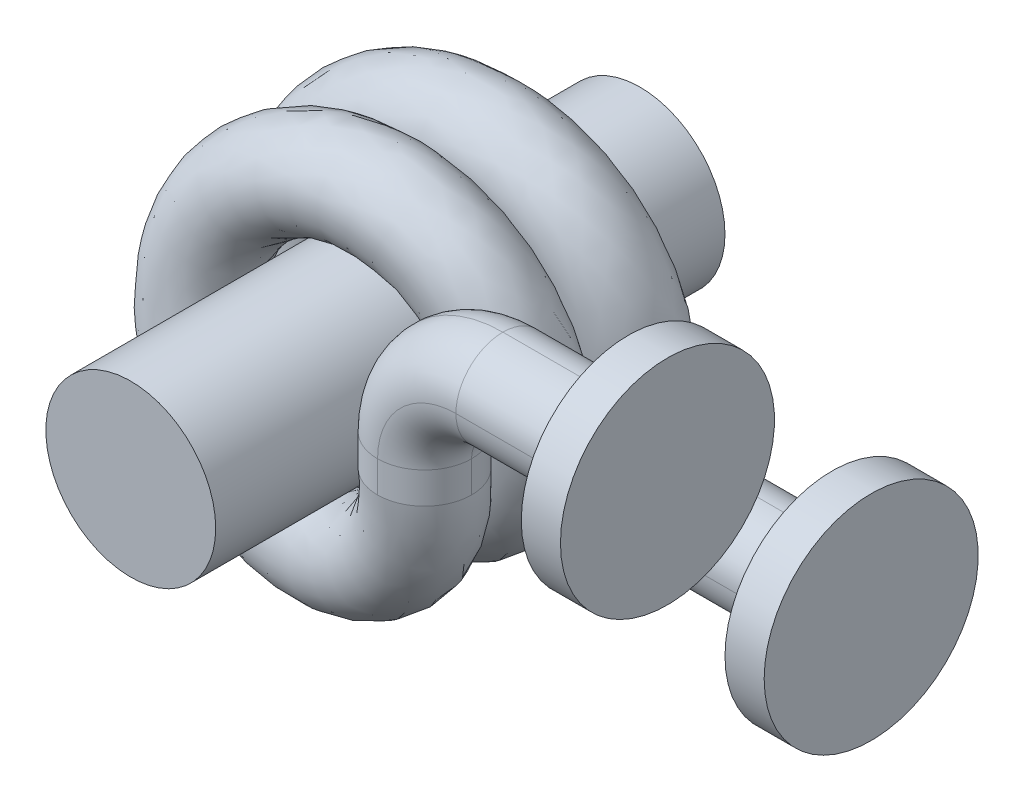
ISO-10303-21;
HEADER;
FILE_DESCRIPTION(('STEP AP214'),'2;1');
FILE_NAME('part.step','',(''),(''),'','','');
FILE_SCHEMA(('AUTOMOTIVE_DESIGN { 1 0 10303 214 1 1 1 1 }'));
ENDSEC;
DATA;
#1=APPLICATION_CONTEXT('core data for automotive mechanical design processes');
#2=APPLICATION_PROTOCOL_DEFINITION('international standard','automotive_design',2000,#1);
#3=PRODUCT_CONTEXT('',#1,'mechanical');
#4=PRODUCT('Part','Part','',(#3));
#5=PRODUCT_RELATED_PRODUCT_CATEGORY('part','',(#4));
#6=PRODUCT_DEFINITION_FORMATION('','',#4);
#7=PRODUCT_DEFINITION_CONTEXT('part definition',#1,'design');
#8=PRODUCT_DEFINITION('design','',#6,#7);
#9=PRODUCT_DEFINITION_SHAPE('','',#8);
#10=(LENGTH_UNIT() NAMED_UNIT(*) SI_UNIT(.MILLI.,.METRE.));
#11=(NAMED_UNIT(*) PLANE_ANGLE_UNIT() SI_UNIT($,.RADIAN.));
#12=(NAMED_UNIT(*) SI_UNIT($,.STERADIAN.) SOLID_ANGLE_UNIT());
#13=UNCERTAINTY_MEASURE_WITH_UNIT(LENGTH_MEASURE(1.E-05),#10,'distance_accuracy_value','');
#14=(GEOMETRIC_REPRESENTATION_CONTEXT(3) GLOBAL_UNCERTAINTY_ASSIGNED_CONTEXT((#13)) GLOBAL_UNIT_ASSIGNED_CONTEXT((#10,
#11,#12)) REPRESENTATION_CONTEXT('',''));
#15=CARTESIAN_POINT('',(0.,0.,0.));
#16=DIRECTION('',(0.,0.,1.));
#17=DIRECTION('',(1.,0.,0.));
#18=AXIS2_PLACEMENT_3D('',#15,#16,#17);
#19=CARTESIAN_POINT('',(0.,0.,2.));
#20=DIRECTION('',(0.,0.,-1.));
#21=DIRECTION('',(1.,0.,0.));
#22=AXIS2_PLACEMENT_3D('',#19,#20,#21);
#23=CYLINDRICAL_SURFACE('',#22,1.08399992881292);
#24=CARTESIAN_POINT('',(0.,0.,2.));
#25=DIRECTION('',(0.,0.,1.));
#26=DIRECTION('',(1.,0.,0.));
#27=AXIS2_PLACEMENT_3D('',#24,#25,#26);
#28=CIRCLE('',#27,1.08399992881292);
#29=CARTESIAN_POINT('',(1.08399992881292,0.,2.));
#30=VERTEX_POINT('',#29);
#31=EDGE_CURVE('E11',#30,#30,#28,.T.);
#32=ORIENTED_EDGE('',*,*,#31,.F.);
#33=EDGE_LOOP('',(#32));
#34=FACE_BOUND('',#33,.T.);
#35=CARTESIAN_POINT('',(0.,0.,-4.5));
#36=DIRECTION('',(0.,0.,1.));
#37=DIRECTION('',(1.,0.,0.));
#38=AXIS2_PLACEMENT_3D('',#35,#36,#37);
#39=CIRCLE('',#38,1.08399992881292);
#40=CARTESIAN_POINT('',(1.08399992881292,0.,-4.5));
#41=VERTEX_POINT('',#40);
#42=EDGE_CURVE('E51',#41,#41,#39,.T.);
#43=ORIENTED_EDGE('',*,*,#42,.T.);
#44=EDGE_LOOP('',(#43));
#45=FACE_BOUND('',#44,.T.);
#46=ADVANCED_FACE('F45',(#34,#45),#23,.T.);
#47=CARTESIAN_POINT('',(0.,0.,2.));
#48=DIRECTION('',(0.,0.,-1.));
#49=DIRECTION('',(1.,0.,0.));
#50=AXIS2_PLACEMENT_3D('',#47,#48,#49);
#51=PLANE('',#50);
#52=ORIENTED_EDGE('',*,*,#31,.T.);
#53=EDGE_LOOP('',(#52));
#54=FACE_BOUND('',#53,.T.);
#55=ADVANCED_FACE('F60',(#54),#51,.F.);
#56=CARTESIAN_POINT('',(0.,0.,-4.5));
#57=DIRECTION('',(0.,0.,-1.));
#58=DIRECTION('',(1.,0.,0.));
#59=AXIS2_PLACEMENT_3D('',#56,#57,#58);
#60=PLANE('',#59);
#61=ORIENTED_EDGE('',*,*,#42,.F.);
#62=EDGE_LOOP('',(#61));
#63=FACE_BOUND('',#62,.T.);
#64=ADVANCED_FACE('F58',(#63),#60,.T.);
#65=CLOSED_SHELL('',(#46,#55,#64));
#66=MANIFOLD_SOLID_BREP('B2',#65);
#67=CARTESIAN_POINT('',(1.75,278.593538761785,30.6271281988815));
#68=CARTESIAN_POINT('',(1.75,182.157313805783,19.8177376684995));
#69=CARTESIAN_POINT('',(1.75,85.7210888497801,9.00834713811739));
#70=CARTESIAN_POINT('',(1.75,53.5756805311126,5.40521696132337));
#71=CARTESIAN_POINT('',(1.75,21.430272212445,1.80208678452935));
#72=CARTESIAN_POINT('',(1.75,10.7151361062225,0.601043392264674));
#73=CARTESIAN_POINT('',(1.75,0.,-0.6));
#74=CARTESIAN_POINT('',(1.75,-0.724873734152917,-0.68125));
#75=CARTESIAN_POINT('',(1.23743686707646,-1.23743686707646,-0.7625));
#76=CARTESIAN_POINT('',(0.724873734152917,-1.75,-0.84375));
#77=CARTESIAN_POINT('',(0.,-1.75,-0.925));
#78=CARTESIAN_POINT('',(-0.724873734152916,-1.75,-1.00625));
#79=CARTESIAN_POINT('',(-1.23743686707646,-1.23743686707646,-1.0875));
#80=CARTESIAN_POINT('',(-1.75,-0.724873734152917,-1.16875));
#81=CARTESIAN_POINT('',(-1.75,0.,-1.25));
#82=CARTESIAN_POINT('',(-1.75,0.724873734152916,-1.33125));
#83=CARTESIAN_POINT('',(-1.23743686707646,1.23743686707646,-1.4125));
#84=CARTESIAN_POINT('',(-0.724873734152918,1.75,-1.49375));
#85=CARTESIAN_POINT('',(0.,1.75,-1.575));
#86=CARTESIAN_POINT('',(0.724873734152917,1.75,-1.65625));
#87=CARTESIAN_POINT('',(1.23743686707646,1.23743686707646,-1.7375));
#88=CARTESIAN_POINT('',(1.75,0.724873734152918,-1.81875));
#89=CARTESIAN_POINT('',(1.75,0.,-1.9));
#90=CARTESIAN_POINT('',(1.75,-0.724873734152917,-1.98125));
#91=CARTESIAN_POINT('',(1.23743686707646,-1.23743686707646,-2.0625));
#92=CARTESIAN_POINT('',(0.724873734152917,-1.75,-2.14375));
#93=CARTESIAN_POINT('',(0.,-1.75,-2.225));
#94=CARTESIAN_POINT('',(-0.724873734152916,-1.75,-2.30625));
#95=CARTESIAN_POINT('',(-1.23743686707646,-1.23743686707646,-2.3875));
#96=CARTESIAN_POINT('',(-1.75,-0.724873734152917,-2.46875));
#97=CARTESIAN_POINT('',(-1.75,0.,-2.55));
#98=CARTESIAN_POINT('',(-1.75,0.724873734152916,-2.63125));
#99=CARTESIAN_POINT('',(-1.23743686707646,1.23743686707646,-2.7125));
#100=CARTESIAN_POINT('',(-0.724873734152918,1.75,-2.79375));
#101=CARTESIAN_POINT('',(0.,1.75,-2.875));
#102=CARTESIAN_POINT('',(0.724873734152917,1.75,-2.95625));
#103=CARTESIAN_POINT('',(1.23743686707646,1.23743686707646,-3.0375));
#104=CARTESIAN_POINT('',(1.75,0.724873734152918,-3.11875));
#105=CARTESIAN_POINT('',(1.75,0.,-3.2));
#106=CARTESIAN_POINT('',(1.75000000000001,-10.7151361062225,-4.40104339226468));
#107=CARTESIAN_POINT('',(1.75000000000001,-21.4302722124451,-5.60208678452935));
#108=CARTESIAN_POINT('',(1.75000000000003,-53.5756805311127,-9.20521696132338));
#109=CARTESIAN_POINT('',(1.75000000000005,-85.7210888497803,-12.8083471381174));
#110=CARTESIAN_POINT('',(1.75000000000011,-182.157313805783,-23.6177376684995));
#111=CARTESIAN_POINT('',(1.75000000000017,-278.593538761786,-34.4271281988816));
#112=CARTESIAN_POINT('',(2.95,469.629108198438,30.6271281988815));
#113=CARTESIAN_POINT('',(2.95,307.065186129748,19.8177376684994));
#114=CARTESIAN_POINT('',(2.95,144.501264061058,9.00834713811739));
#115=CARTESIAN_POINT('',(2.95,90.3132900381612,5.40521696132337));
#116=CARTESIAN_POINT('',(2.95,36.1253160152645,1.80208678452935));
#117=CARTESIAN_POINT('',(2.95,18.0626580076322,0.601043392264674));
#118=CARTESIAN_POINT('',(2.95,0.,-0.6));
#119=CARTESIAN_POINT('',(2.95,-1.22193000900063,-0.68125));
#120=CARTESIAN_POINT('',(2.08596500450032,-2.08596500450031,-0.7625));
#121=CARTESIAN_POINT('',(1.22193000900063,-2.95,-0.84375));
#122=CARTESIAN_POINT('',(0.,-2.95,-0.925));
#123=CARTESIAN_POINT('',(-1.22193000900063,-2.95,-1.00625));
#124=CARTESIAN_POINT('',(-2.08596500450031,-2.08596500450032,-1.0875));
#125=CARTESIAN_POINT('',(-2.95,-1.22193000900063,-1.16875));
#126=CARTESIAN_POINT('',(-2.95,0.,-1.25));
#127=CARTESIAN_POINT('',(-2.95,1.22193000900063,-1.33125));
#128=CARTESIAN_POINT('',(-2.08596500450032,2.08596500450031,-1.4125));
#129=CARTESIAN_POINT('',(-1.22193000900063,2.95,-1.49375));
#130=CARTESIAN_POINT('',(0.,2.95,-1.575));
#131=CARTESIAN_POINT('',(1.22193000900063,2.95,-1.65625));
#132=CARTESIAN_POINT('',(2.08596500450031,2.08596500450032,-1.7375));
#133=CARTESIAN_POINT('',(2.95,1.22193000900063,-1.81875));
#134=CARTESIAN_POINT('',(2.95,0.,-1.9));
#135=CARTESIAN_POINT('',(2.95,-1.22193000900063,-1.98125));
#136=CARTESIAN_POINT('',(2.08596500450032,-2.08596500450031,-2.0625));
#137=CARTESIAN_POINT('',(1.22193000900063,-2.95,-2.14375));
#138=CARTESIAN_POINT('',(0.,-2.95,-2.225));
#139=CARTESIAN_POINT('',(-1.22193000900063,-2.95,-2.30625));
#140=CARTESIAN_POINT('',(-2.08596500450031,-2.08596500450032,-2.3875));
#141=CARTESIAN_POINT('',(-2.95,-1.22193000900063,-2.46875));
#142=CARTESIAN_POINT('',(-2.95,0.,-2.55));
#143=CARTESIAN_POINT('',(-2.95,1.22193000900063,-2.63125));
#144=CARTESIAN_POINT('',(-2.08596500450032,2.08596500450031,-2.7125));
#145=CARTESIAN_POINT('',(-1.22193000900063,2.95,-2.79375));
#146=CARTESIAN_POINT('',(0.,2.95,-2.875));
#147=CARTESIAN_POINT('',(1.22193000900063,2.95,-2.95625));
#148=CARTESIAN_POINT('',(2.08596500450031,2.08596500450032,-3.0375));
#149=CARTESIAN_POINT('',(2.95,1.22193000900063,-3.11875));
#150=CARTESIAN_POINT('',(2.95,0.,-3.2));
#151=CARTESIAN_POINT('',(2.95000000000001,-18.0626580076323,-4.40104339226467));
#152=CARTESIAN_POINT('',(2.95000000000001,-36.1253160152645,-5.60208678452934));
#153=CARTESIAN_POINT('',(2.95000000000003,-90.3132900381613,-9.20521696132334));
#154=CARTESIAN_POINT('',(2.95000000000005,-144.501264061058,-12.8083471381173));
#155=CARTESIAN_POINT('',(2.95000000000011,-307.065186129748,-23.6177376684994));
#156=CARTESIAN_POINT('',(2.95000000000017,-469.629108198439,-34.4271281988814));
#157=CARTESIAN_POINT('',(2.95,469.629108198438,31.8271281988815));
#158=CARTESIAN_POINT('',(2.95,307.065186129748,21.0177376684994));
#159=CARTESIAN_POINT('',(2.95,144.501264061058,10.2083471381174));
#160=CARTESIAN_POINT('',(2.95,90.3132900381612,6.60521696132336));
#161=CARTESIAN_POINT('',(2.95,36.1253160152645,3.00208678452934));
#162=CARTESIAN_POINT('',(2.95,18.0626580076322,1.80104339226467));
#163=CARTESIAN_POINT('',(2.95,0.,0.6));
#164=CARTESIAN_POINT('',(2.95,-1.22193000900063,0.51875));
#165=CARTESIAN_POINT('',(2.08596500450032,-2.08596500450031,0.4375));
#166=CARTESIAN_POINT('',(1.22193000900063,-2.95,0.35625));
#167=CARTESIAN_POINT('',(0.,-2.95,0.275));
#168=CARTESIAN_POINT('',(-1.22193000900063,-2.95,0.19375));
#169=CARTESIAN_POINT('',(-2.08596500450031,-2.08596500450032,0.1125));
#170=CARTESIAN_POINT('',(-2.95,-1.22193000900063,0.0312499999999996));
#171=CARTESIAN_POINT('',(-2.95,0.,-0.0500000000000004));
#172=CARTESIAN_POINT('',(-2.95,1.22193000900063,-0.13125));
#173=CARTESIAN_POINT('',(-2.08596500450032,2.08596500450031,-0.2125));
#174=CARTESIAN_POINT('',(-1.22193000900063,2.95,-0.29375));
#175=CARTESIAN_POINT('',(0.,2.95,-0.375));
#176=CARTESIAN_POINT('',(1.22193000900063,2.95,-0.45625));
#177=CARTESIAN_POINT('',(2.08596500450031,2.08596500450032,-0.5375));
#178=CARTESIAN_POINT('',(2.95,1.22193000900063,-0.61875));
#179=CARTESIAN_POINT('',(2.95,0.,-0.7));
#180=CARTESIAN_POINT('',(2.95,-1.22193000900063,-0.78125));
#181=CARTESIAN_POINT('',(2.08596500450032,-2.08596500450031,-0.8625));
#182=CARTESIAN_POINT('',(1.22193000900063,-2.95,-0.94375));
#183=CARTESIAN_POINT('',(0.,-2.95,-1.025));
#184=CARTESIAN_POINT('',(-1.22193000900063,-2.95,-1.10625));
#185=CARTESIAN_POINT('',(-2.08596500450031,-2.08596500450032,-1.1875));
#186=CARTESIAN_POINT('',(-2.95,-1.22193000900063,-1.26875));
#187=CARTESIAN_POINT('',(-2.95,0.,-1.35));
#188=CARTESIAN_POINT('',(-2.95,1.22193000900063,-1.43125));
#189=CARTESIAN_POINT('',(-2.08596500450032,2.08596500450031,-1.5125));
#190=CARTESIAN_POINT('',(-1.22193000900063,2.95,-1.59375));
#191=CARTESIAN_POINT('',(0.,2.95,-1.675));
#192=CARTESIAN_POINT('',(1.22193000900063,2.95,-1.75625));
#193=CARTESIAN_POINT('',(2.08596500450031,2.08596500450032,-1.8375));
#194=CARTESIAN_POINT('',(2.95,1.22193000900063,-1.91875));
#195=CARTESIAN_POINT('',(2.95,0.,-2.));
#196=CARTESIAN_POINT('',(2.95000000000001,-18.0626580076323,-3.20104339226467));
#197=CARTESIAN_POINT('',(2.95000000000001,-36.1253160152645,-4.40208678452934));
#198=CARTESIAN_POINT('',(2.95000000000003,-90.3132900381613,-8.00521696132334));
#199=CARTESIAN_POINT('',(2.95000000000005,-144.501264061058,-11.6083471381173));
#200=CARTESIAN_POINT('',(2.95000000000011,-307.065186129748,-22.4177376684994));
#201=CARTESIAN_POINT('',(2.95000000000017,-469.629108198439,-33.2271281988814));
#202=CARTESIAN_POINT('',(1.75,278.593538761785,31.8271281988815));
#203=CARTESIAN_POINT('',(1.75,182.157313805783,21.0177376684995));
#204=CARTESIAN_POINT('',(1.75,85.7210888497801,10.2083471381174));
#205=CARTESIAN_POINT('',(1.75,53.5756805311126,6.60521696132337));
#206=CARTESIAN_POINT('',(1.75,21.430272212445,3.00208678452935));
#207=CARTESIAN_POINT('',(1.75,10.7151361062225,1.80104339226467));
#208=CARTESIAN_POINT('',(1.75,0.,0.6));
#209=CARTESIAN_POINT('',(1.75,-0.724873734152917,0.51875));
#210=CARTESIAN_POINT('',(1.23743686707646,-1.23743686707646,0.4375));
#211=CARTESIAN_POINT('',(0.724873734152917,-1.75,0.35625));
#212=CARTESIAN_POINT('',(0.,-1.75,0.275));
#213=CARTESIAN_POINT('',(-0.724873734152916,-1.75,0.19375));
#214=CARTESIAN_POINT('',(-1.23743686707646,-1.23743686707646,0.1125));
#215=CARTESIAN_POINT('',(-1.75,-0.724873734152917,0.0312499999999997));
#216=CARTESIAN_POINT('',(-1.75,0.,-0.0500000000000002));
#217=CARTESIAN_POINT('',(-1.75,0.724873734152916,-0.13125));
#218=CARTESIAN_POINT('',(-1.23743686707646,1.23743686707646,-0.2125));
#219=CARTESIAN_POINT('',(-0.724873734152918,1.75,-0.29375));
#220=CARTESIAN_POINT('',(0.,1.75,-0.375));
#221=CARTESIAN_POINT('',(0.724873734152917,1.75,-0.45625));
#222=CARTESIAN_POINT('',(1.23743686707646,1.23743686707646,-0.5375));
#223=CARTESIAN_POINT('',(1.75,0.724873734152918,-0.61875));
#224=CARTESIAN_POINT('',(1.75,0.,-0.7));
#225=CARTESIAN_POINT('',(1.75,-0.724873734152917,-0.78125));
#226=CARTESIAN_POINT('',(1.23743686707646,-1.23743686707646,-0.8625));
#227=CARTESIAN_POINT('',(0.724873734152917,-1.75,-0.94375));
#228=CARTESIAN_POINT('',(0.,-1.75,-1.025));
#229=CARTESIAN_POINT('',(-0.724873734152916,-1.75,-1.10625));
#230=CARTESIAN_POINT('',(-1.23743686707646,-1.23743686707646,-1.1875));
#231=CARTESIAN_POINT('',(-1.75,-0.724873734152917,-1.26875));
#232=CARTESIAN_POINT('',(-1.75,0.,-1.35));
#233=CARTESIAN_POINT('',(-1.75,0.724873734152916,-1.43125));
#234=CARTESIAN_POINT('',(-1.23743686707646,1.23743686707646,-1.5125));
#235=CARTESIAN_POINT('',(-0.724873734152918,1.75,-1.59375));
#236=CARTESIAN_POINT('',(0.,1.75,-1.675));
#237=CARTESIAN_POINT('',(0.724873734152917,1.75,-1.75625));
#238=CARTESIAN_POINT('',(1.23743686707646,1.23743686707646,-1.8375));
#239=CARTESIAN_POINT('',(1.75,0.724873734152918,-1.91875));
#240=CARTESIAN_POINT('',(1.75,0.,-2.));
#241=CARTESIAN_POINT('',(1.75000000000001,-10.7151361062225,-3.20104339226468));
#242=CARTESIAN_POINT('',(1.75000000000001,-21.4302722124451,-4.40208678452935));
#243=CARTESIAN_POINT('',(1.75000000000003,-53.5756805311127,-8.00521696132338));
#244=CARTESIAN_POINT('',(1.75000000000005,-85.7210888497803,-11.6083471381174));
#245=CARTESIAN_POINT('',(1.75000000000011,-182.157313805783,-22.4177376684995));
#246=CARTESIAN_POINT('',(1.75000000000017,-278.593538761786,-33.2271281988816));
#247=CARTESIAN_POINT('',(0.550000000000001,87.5579693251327,31.8271281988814));
#248=CARTESIAN_POINT('',(0.550000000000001,57.2494414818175,21.0177376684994));
#249=CARTESIAN_POINT('',(0.550000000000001,26.9409136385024,10.2083471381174));
#250=CARTESIAN_POINT('',(0.550000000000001,16.838071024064,6.60521696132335));
#251=CARTESIAN_POINT('',(0.550000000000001,6.73522840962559,3.00208678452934));
#252=CARTESIAN_POINT('',(0.550000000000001,3.3676142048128,1.80104339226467));
#253=CARTESIAN_POINT('',(0.550000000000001,0.,0.6));
#254=CARTESIAN_POINT('',(0.550000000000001,-0.227817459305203,0.51875));
#255=CARTESIAN_POINT('',(0.388908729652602,-0.388908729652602,0.4375));
#256=CARTESIAN_POINT('',(0.227817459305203,-0.550000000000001,0.35625));
#257=CARTESIAN_POINT('',(0.,-0.550000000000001,0.275));
#258=CARTESIAN_POINT('',(-0.227817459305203,-0.550000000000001,0.19375));
#259=CARTESIAN_POINT('',(-0.388908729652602,-0.388908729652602,0.1125));
#260=CARTESIAN_POINT('',(-0.550000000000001,-0.227817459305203,0.0312499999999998));
#261=CARTESIAN_POINT('',(-0.550000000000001,0.,-0.0500000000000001));
#262=CARTESIAN_POINT('',(-0.550000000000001,0.227817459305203,-0.13125));
#263=CARTESIAN_POINT('',(-0.388908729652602,0.388908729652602,-0.2125));
#264=CARTESIAN_POINT('',(-0.227817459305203,0.550000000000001,-0.29375));
#265=CARTESIAN_POINT('',(0.,0.550000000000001,-0.375));
#266=CARTESIAN_POINT('',(0.227817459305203,0.550000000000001,-0.45625));
#267=CARTESIAN_POINT('',(0.388908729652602,0.388908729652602,-0.5375));
#268=CARTESIAN_POINT('',(0.550000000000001,0.227817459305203,-0.61875));
#269=CARTESIAN_POINT('',(0.550000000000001,0.,-0.7));
#270=CARTESIAN_POINT('',(0.550000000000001,-0.227817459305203,-0.78125));
#271=CARTESIAN_POINT('',(0.388908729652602,-0.388908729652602,-0.8625));
#272=CARTESIAN_POINT('',(0.227817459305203,-0.550000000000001,-0.94375));
#273=CARTESIAN_POINT('',(0.,-0.550000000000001,-1.025));
#274=CARTESIAN_POINT('',(-0.227817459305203,-0.550000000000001,-1.10625));
#275=CARTESIAN_POINT('',(-0.388908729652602,-0.388908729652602,-1.1875));
#276=CARTESIAN_POINT('',(-0.550000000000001,-0.227817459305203,-1.26875));
#277=CARTESIAN_POINT('',(-0.550000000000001,0.,-1.35));
#278=CARTESIAN_POINT('',(-0.550000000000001,0.227817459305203,-1.43125));
#279=CARTESIAN_POINT('',(-0.388908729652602,0.388908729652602,-1.5125));
#280=CARTESIAN_POINT('',(-0.227817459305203,0.550000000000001,-1.59375));
#281=CARTESIAN_POINT('',(0.,0.550000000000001,-1.675));
#282=CARTESIAN_POINT('',(0.227817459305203,0.550000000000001,-1.75625));
#283=CARTESIAN_POINT('',(0.388908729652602,0.388908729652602,-1.8375));
#284=CARTESIAN_POINT('',(0.550000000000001,0.227817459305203,-1.91875));
#285=CARTESIAN_POINT('',(0.550000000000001,0.,-2.));
#286=CARTESIAN_POINT('',(0.550000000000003,-3.3676142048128,-3.20104339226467));
#287=CARTESIAN_POINT('',(0.550000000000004,-6.7352284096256,-4.40208678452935));
#288=CARTESIAN_POINT('',(0.550000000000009,-16.838071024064,-8.00521696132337));
#289=CARTESIAN_POINT('',(0.550000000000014,-26.9409136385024,-11.6083471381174));
#290=CARTESIAN_POINT('',(0.550000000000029,-57.2494414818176,-22.4177376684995));
#291=CARTESIAN_POINT('',(0.550000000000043,-87.5579693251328,-33.2271281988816));
#292=CARTESIAN_POINT('',(0.550000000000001,87.5579693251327,30.6271281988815));
#293=CARTESIAN_POINT('',(0.550000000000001,57.2494414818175,19.8177376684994));
#294=CARTESIAN_POINT('',(0.550000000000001,26.9409136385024,9.00834713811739));
#295=CARTESIAN_POINT('',(0.550000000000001,16.838071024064,5.40521696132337));
#296=CARTESIAN_POINT('',(0.550000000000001,6.73522840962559,1.80208678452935));
#297=CARTESIAN_POINT('',(0.550000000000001,3.3676142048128,0.601043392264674));
#298=CARTESIAN_POINT('',(0.550000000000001,0.,-0.6));
#299=CARTESIAN_POINT('',(0.550000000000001,-0.227817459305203,-0.68125));
#300=CARTESIAN_POINT('',(0.388908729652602,-0.388908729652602,-0.7625));
#301=CARTESIAN_POINT('',(0.227817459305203,-0.550000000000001,-0.84375));
#302=CARTESIAN_POINT('',(0.,-0.550000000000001,-0.925));
#303=CARTESIAN_POINT('',(-0.227817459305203,-0.550000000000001,-1.00625));
#304=CARTESIAN_POINT('',(-0.388908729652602,-0.388908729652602,-1.0875));
#305=CARTESIAN_POINT('',(-0.550000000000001,-0.227817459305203,-1.16875));
#306=CARTESIAN_POINT('',(-0.550000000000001,0.,-1.25));
#307=CARTESIAN_POINT('',(-0.550000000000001,0.227817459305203,-1.33125));
#308=CARTESIAN_POINT('',(-0.388908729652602,0.388908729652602,-1.4125));
#309=CARTESIAN_POINT('',(-0.227817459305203,0.550000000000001,-1.49375));
#310=CARTESIAN_POINT('',(0.,0.550000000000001,-1.575));
#311=CARTESIAN_POINT('',(0.227817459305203,0.550000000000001,-1.65625));
#312=CARTESIAN_POINT('',(0.388908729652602,0.388908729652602,-1.7375));
#313=CARTESIAN_POINT('',(0.550000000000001,0.227817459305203,-1.81875));
#314=CARTESIAN_POINT('',(0.550000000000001,0.,-1.9));
#315=CARTESIAN_POINT('',(0.550000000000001,-0.227817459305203,-1.98125));
#316=CARTESIAN_POINT('',(0.388908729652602,-0.388908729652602,-2.0625));
#317=CARTESIAN_POINT('',(0.227817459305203,-0.550000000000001,-2.14375));
#318=CARTESIAN_POINT('',(0.,-0.550000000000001,-2.225));
#319=CARTESIAN_POINT('',(-0.227817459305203,-0.550000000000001,-2.30625));
#320=CARTESIAN_POINT('',(-0.388908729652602,-0.388908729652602,-2.3875));
#321=CARTESIAN_POINT('',(-0.550000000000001,-0.227817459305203,-2.46875));
#322=CARTESIAN_POINT('',(-0.550000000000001,0.,-2.55));
#323=CARTESIAN_POINT('',(-0.550000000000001,0.227817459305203,-2.63125));
#324=CARTESIAN_POINT('',(-0.388908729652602,0.388908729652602,-2.7125));
#325=CARTESIAN_POINT('',(-0.227817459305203,0.550000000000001,-2.79375));
#326=CARTESIAN_POINT('',(0.,0.550000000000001,-2.875));
#327=CARTESIAN_POINT('',(0.227817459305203,0.550000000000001,-2.95625));
#328=CARTESIAN_POINT('',(0.388908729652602,0.388908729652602,-3.0375));
#329=CARTESIAN_POINT('',(0.550000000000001,0.227817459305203,-3.11875));
#330=CARTESIAN_POINT('',(0.550000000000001,0.,-3.2));
#331=CARTESIAN_POINT('',(0.550000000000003,-3.3676142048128,-4.40104339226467));
#332=CARTESIAN_POINT('',(0.550000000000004,-6.7352284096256,-5.60208678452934));
#333=CARTESIAN_POINT('',(0.550000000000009,-16.838071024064,-9.20521696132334));
#334=CARTESIAN_POINT('',(0.550000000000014,-26.9409136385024,-12.8083471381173));
#335=CARTESIAN_POINT('',(0.550000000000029,-57.2494414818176,-23.6177376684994));
#336=CARTESIAN_POINT('',(0.550000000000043,-87.5579693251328,-34.4271281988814));
#337=CARTESIAN_POINT('',(1.75,278.593538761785,30.6271281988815));
#338=CARTESIAN_POINT('',(1.75,182.157313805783,19.8177376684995));
#339=CARTESIAN_POINT('',(1.75,85.7210888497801,9.00834713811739));
#340=CARTESIAN_POINT('',(1.75,53.5756805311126,5.40521696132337));
#341=CARTESIAN_POINT('',(1.75,21.430272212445,1.80208678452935));
#342=CARTESIAN_POINT('',(1.75,10.7151361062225,0.601043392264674));
#343=CARTESIAN_POINT('',(1.75,0.,-0.6));
#344=CARTESIAN_POINT('',(1.75,-0.724873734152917,-0.68125));
#345=CARTESIAN_POINT('',(1.23743686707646,-1.23743686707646,-0.7625));
#346=CARTESIAN_POINT('',(0.724873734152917,-1.75,-0.84375));
#347=CARTESIAN_POINT('',(0.,-1.75,-0.925));
#348=CARTESIAN_POINT('',(-0.724873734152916,-1.75,-1.00625));
#349=CARTESIAN_POINT('',(-1.23743686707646,-1.23743686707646,-1.0875));
#350=CARTESIAN_POINT('',(-1.75,-0.724873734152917,-1.16875));
#351=CARTESIAN_POINT('',(-1.75,0.,-1.25));
#352=CARTESIAN_POINT('',(-1.75,0.724873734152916,-1.33125));
#353=CARTESIAN_POINT('',(-1.23743686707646,1.23743686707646,-1.4125));
#354=CARTESIAN_POINT('',(-0.724873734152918,1.75,-1.49375));
#355=CARTESIAN_POINT('',(0.,1.75,-1.575));
#356=CARTESIAN_POINT('',(0.724873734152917,1.75,-1.65625));
#357=CARTESIAN_POINT('',(1.23743686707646,1.23743686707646,-1.7375));
#358=CARTESIAN_POINT('',(1.75,0.724873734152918,-1.81875));
#359=CARTESIAN_POINT('',(1.75,0.,-1.9));
#360=CARTESIAN_POINT('',(1.75,-0.724873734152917,-1.98125));
#361=CARTESIAN_POINT('',(1.23743686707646,-1.23743686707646,-2.0625));
#362=CARTESIAN_POINT('',(0.724873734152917,-1.75,-2.14375));
#363=CARTESIAN_POINT('',(0.,-1.75,-2.225));
#364=CARTESIAN_POINT('',(-0.724873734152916,-1.75,-2.30625));
#365=CARTESIAN_POINT('',(-1.23743686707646,-1.23743686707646,-2.3875));
#366=CARTESIAN_POINT('',(-1.75,-0.724873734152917,-2.46875));
#367=CARTESIAN_POINT('',(-1.75,0.,-2.55));
#368=CARTESIAN_POINT('',(-1.75,0.724873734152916,-2.63125));
#369=CARTESIAN_POINT('',(-1.23743686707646,1.23743686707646,-2.7125));
#370=CARTESIAN_POINT('',(-0.724873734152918,1.75,-2.79375));
#371=CARTESIAN_POINT('',(0.,1.75,-2.875));
#372=CARTESIAN_POINT('',(0.724873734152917,1.75,-2.95625));
#373=CARTESIAN_POINT('',(1.23743686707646,1.23743686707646,-3.0375));
#374=CARTESIAN_POINT('',(1.75,0.724873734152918,-3.11875));
#375=CARTESIAN_POINT('',(1.75,0.,-3.2));
#376=CARTESIAN_POINT('',(1.75000000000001,-10.7151361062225,-4.40104339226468));
#377=CARTESIAN_POINT('',(1.75000000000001,-21.4302722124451,-5.60208678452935));
#378=CARTESIAN_POINT('',(1.75000000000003,-53.5756805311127,-9.20521696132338));
#379=CARTESIAN_POINT('',(1.75000000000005,-85.7210888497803,-12.8083471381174));
#380=CARTESIAN_POINT('',(1.75000000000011,-182.157313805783,-23.6177376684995));
#381=CARTESIAN_POINT('',(1.75000000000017,-278.593538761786,-34.4271281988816));
#382=(BOUNDED_SURFACE() B_SPLINE_SURFACE(3,2,((#67,#68,#69,#70,#71,#72,#73,#74,#75,#76,#77,#78,
#79,#80,#81,#82,#83,#84,#85,#86,#87,#88,#89,#90,#91,#92,#93,#94,#95,#96,#97,#98,#99,#100,#101,
#102,#103,#104,#105,#106,#107,#108,#109,#110,#111),(#112,#113,#114,#115,#116,#117,#118,#119,
#120,#121,#122,#123,#124,#125,#126,#127,#128,#129,#130,#131,#132,#133,#134,#135,#136,#137,#138,
#139,#140,#141,#142,#143,#144,#145,#146,#147,#148,#149,#150,#151,#152,#153,#154,#155,#156),
(#157,#158,#159,#160,#161,#162,#163,#164,#165,#166,#167,#168,#169,#170,#171,#172,#173,#174,#175,
#176,#177,#178,#179,#180,#181,#182,#183,#184,#185,#186,#187,#188,#189,#190,#191,#192,#193,#194,
#195,#196,#197,#198,#199,#200,#201),(#202,#203,#204,#205,#206,#207,#208,#209,#210,#211,#212,
#213,#214,#215,#216,#217,#218,#219,#220,#221,#222,#223,#224,#225,#226,#227,#228,#229,#230,#231,
#232,#233,#234,#235,#236,#237,#238,#239,#240,#241,#242,#243,#244,#245,#246),(#247,#248,#249,
#250,#251,#252,#253,#254,#255,#256,#257,#258,#259,#260,#261,#262,#263,#264,#265,#266,#267,#268,
#269,#270,#271,#272,#273,#274,#275,#276,#277,#278,#279,#280,#281,#282,#283,#284,#285,#286,#287,
#288,#289,#290,#291),(#292,#293,#294,#295,#296,#297,#298,#299,#300,#301,#302,#303,#304,#305,
#306,#307,#308,#309,#310,#311,#312,#313,#314,#315,#316,#317,#318,#319,#320,#321,#322,#323,#324,
#325,#326,#327,#328,#329,#330,#331,#332,#333,#334,#335,#336),(#337,#338,#339,#340,#341,#342,
#343,#344,#345,#346,#347,#348,#349,#350,#351,#352,#353,#354,#355,#356,#357,#358,#359,#360,#361,
#362,#363,#364,#365,#366,#367,#368,#369,#370,#371,#372,#373,#374,#375,#376,#377,#378,#379,#380,
#381)),.UNSPECIFIED.,.T.,.F.,.F.) B_SPLINE_SURFACE_WITH_KNOTS((4,3,4),(3,2,2,2,2,2,2,2,2,2,2,2,
2,2,2,2,2,2,2,2,2,2,3),(0.,0.5,1.),(-13.,-4.,-1.,0.,0.0625,0.125,0.1875,0.25,0.3125,0.375,
0.4375,0.5,0.5625,0.625,0.6875,0.75,0.8125,0.875,0.9375,1.,2.,5.,14.),
.UNSPECIFIED.) GEOMETRIC_REPRESENTATION_ITEM() RATIONAL_B_SPLINE_SURFACE(((1.,1.,1.,1.,1.,1.,1.,
0.923879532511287,1.,0.923879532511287,1.,0.923879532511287,1.,0.923879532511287,1.,
0.923879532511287,1.,0.923879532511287,1.,0.923879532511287,1.,0.923879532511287,1.,
0.923879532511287,1.,0.923879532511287,1.,0.923879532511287,1.,0.923879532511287,1.,
0.923879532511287,1.,0.923879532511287,1.,0.923879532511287,1.,0.923879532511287,1.,1.,1.,1.,1.,
1.,1.),(0.333333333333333,0.333333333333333,0.333333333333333,0.333333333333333,
0.333333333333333,0.333333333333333,0.333333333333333,0.307959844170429,0.333333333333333,
0.307959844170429,0.333333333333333,0.307959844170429,0.333333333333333,0.307959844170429,
0.333333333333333,0.307959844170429,0.333333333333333,0.307959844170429,0.333333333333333,
0.307959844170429,0.333333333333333,0.307959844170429,0.333333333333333,0.307959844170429,
0.333333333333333,0.307959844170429,0.333333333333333,0.307959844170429,0.333333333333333,
0.307959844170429,0.333333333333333,0.307959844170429,0.333333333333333,0.307959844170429,
0.333333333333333,0.307959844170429,0.333333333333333,0.307959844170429,0.333333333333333,
0.333333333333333,0.333333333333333,0.333333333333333,0.333333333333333,0.333333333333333,
0.333333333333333),(0.333333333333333,0.333333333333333,0.333333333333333,0.333333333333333,
0.333333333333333,0.333333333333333,0.333333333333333,0.307959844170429,0.333333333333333,
0.307959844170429,0.333333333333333,0.307959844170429,0.333333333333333,0.307959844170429,
0.333333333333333,0.307959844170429,0.333333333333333,0.307959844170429,0.333333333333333,
0.307959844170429,0.333333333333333,0.307959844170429,0.333333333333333,0.307959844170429,
0.333333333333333,0.307959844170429,0.333333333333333,0.307959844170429,0.333333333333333,
0.307959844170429,0.333333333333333,0.307959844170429,0.333333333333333,0.307959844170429,
0.333333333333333,0.307959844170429,0.333333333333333,0.307959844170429,0.333333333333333,
0.333333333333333,0.333333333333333,0.333333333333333,0.333333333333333,0.333333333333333,
0.333333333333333),(1.,1.,1.,1.,1.,1.,1.,0.923879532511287,1.,0.923879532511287,1.,
0.923879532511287,1.,0.923879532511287,1.,0.923879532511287,1.,0.923879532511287,1.,
0.923879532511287,1.,0.923879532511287,1.,0.923879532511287,1.,0.923879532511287,1.,
0.923879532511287,1.,0.923879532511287,1.,0.923879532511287,1.,0.923879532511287,1.,
0.923879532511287,1.,0.923879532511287,1.,1.,1.,1.,1.,1.,1.),(0.333333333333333,
0.333333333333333,0.333333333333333,0.333333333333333,0.333333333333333,0.333333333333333,
0.333333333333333,0.307959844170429,0.333333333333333,0.307959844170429,0.333333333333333,
0.307959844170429,0.333333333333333,0.307959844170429,0.333333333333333,0.307959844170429,
0.333333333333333,0.307959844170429,0.333333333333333,0.307959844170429,0.333333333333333,
0.307959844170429,0.333333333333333,0.307959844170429,0.333333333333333,0.307959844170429,
0.333333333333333,0.307959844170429,0.333333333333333,0.307959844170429,0.333333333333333,
0.307959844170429,0.333333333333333,0.307959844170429,0.333333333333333,0.307959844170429,
0.333333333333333,0.307959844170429,0.333333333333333,0.333333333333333,0.333333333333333,
0.333333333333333,0.333333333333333,0.333333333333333,0.333333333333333),(0.333333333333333,
0.333333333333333,0.333333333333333,0.333333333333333,0.333333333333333,0.333333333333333,
0.333333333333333,0.307959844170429,0.333333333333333,0.307959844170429,0.333333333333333,
0.307959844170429,0.333333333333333,0.307959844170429,0.333333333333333,0.307959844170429,
0.333333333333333,0.307959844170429,0.333333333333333,0.307959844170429,0.333333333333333,
0.307959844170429,0.333333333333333,0.307959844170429,0.333333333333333,0.307959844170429,
0.333333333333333,0.307959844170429,0.333333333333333,0.307959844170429,0.333333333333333,
0.307959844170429,0.333333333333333,0.307959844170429,0.333333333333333,0.307959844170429,
0.333333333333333,0.307959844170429,0.333333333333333,0.333333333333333,0.333333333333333,
0.333333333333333,0.333333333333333,0.333333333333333,0.333333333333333),(1.,1.,1.,1.,1.,1.,1.,
0.923879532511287,1.,0.923879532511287,1.,0.923879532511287,1.,0.923879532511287,1.,
0.923879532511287,1.,0.923879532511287,1.,0.923879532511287,1.,0.923879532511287,1.,
0.923879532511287,1.,0.923879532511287,1.,0.923879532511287,1.,0.923879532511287,1.,
0.923879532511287,1.,0.923879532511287,1.,0.923879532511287,1.,0.923879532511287,1.,1.,1.,1.,1.,
1.,1.))) REPRESENTATION_ITEM('') SURFACE());
#383=CARTESIAN_POINT('',(1.75,0.,-2.6));
#384=DIRECTION('',(0.,1.,0.));
#385=DIRECTION('',(0.,0.,1.));
#386=AXIS2_PLACEMENT_3D('',#383,#384,#385);
#387=CIRCLE('',#386,0.6);
#388=CARTESIAN_POINT('',(1.75,0.,-2.));
#389=VERTEX_POINT('',#388);
#390=CARTESIAN_POINT('',(2.35,0.,-2.6));
#391=VERTEX_POINT('',#390);
#392=EDGE_CURVE('E255',#389,#391,#387,.T.);
#393=CARTESIAN_POINT('',(1.75,0.,-3.2));
#394=VERTEX_POINT('',#393);
#395=EDGE_CURVE('E259',#391,#394,#387,.T.);
#396=CARTESIAN_POINT('',(1.15,0.,-2.6));
#397=VERTEX_POINT('',#396);
#398=EDGE_CURVE('E484',#394,#397,#387,.T.);
#399=EDGE_CURVE('E260',#397,#389,#387,.T.);
#400=CARTESIAN_POINT('',(1.75,0.,0.));
#401=DIRECTION('',(0.,-1.,0.));
#402=DIRECTION('',(0.,0.,-1.));
#403=AXIS2_PLACEMENT_3D('',#400,#401,#402);
#404=CIRCLE('',#403,0.6);
#405=CARTESIAN_POINT('',(1.75,0.,-0.6));
#406=VERTEX_POINT('',#405);
#407=CARTESIAN_POINT('',(2.35,0.,0.));
#408=VERTEX_POINT('',#407);
#409=EDGE_CURVE('E318',#406,#408,#404,.T.);
#410=CARTESIAN_POINT('',(1.75,0.,0.));
#411=DIRECTION('',(0.,1.,0.));
#412=DIRECTION('',(0.,0.,1.));
#413=AXIS2_PLACEMENT_3D('',#410,#411,#412);
#414=CIRCLE('',#413,0.6);
#415=CARTESIAN_POINT('',(1.75,0.,0.6));
#416=VERTEX_POINT('',#415);
#417=EDGE_CURVE('E248',#416,#408,#414,.T.);
#418=CARTESIAN_POINT('',(1.75,0.,0.));
#419=DIRECTION('',(0.,1.,0.));
#420=DIRECTION('',(0.,0.,1.));
#421=AXIS2_PLACEMENT_3D('',#418,#419,#420);
#422=CIRCLE('',#421,0.6);
#423=CARTESIAN_POINT('',(1.15,0.,0.));
#424=VERTEX_POINT('',#423);
#425=EDGE_CURVE('E326',#424,#416,#422,.T.);
#426=CARTESIAN_POINT('',(1.75,0.,0.));
#427=DIRECTION('',(0.,1.,0.));
#428=DIRECTION('',(0.,0.,1.));
#429=AXIS2_PLACEMENT_3D('',#426,#427,#428);
#430=CIRCLE('',#429,0.6);
#431=EDGE_CURVE('E323',#406,#424,#430,.T.);
#432=ORIENTED_EDGE('',*,*,#392,.T.);
#433=ORIENTED_EDGE('',*,*,#395,.T.);
#434=ORIENTED_EDGE('',*,*,#398,.T.);
#435=ORIENTED_EDGE('',*,*,#399,.T.);
#436=EDGE_LOOP('',(#432,#433,#434,#435));
#437=FACE_BOUND('',#436,.T.);
#438=ORIENTED_EDGE('',*,*,#409,.T.);
#439=ORIENTED_EDGE('',*,*,#417,.F.);
#440=ORIENTED_EDGE('',*,*,#425,.F.);
#441=ORIENTED_EDGE('',*,*,#431,.F.);
#442=EDGE_LOOP('',(#438,#439,#440,#441));
#443=FACE_BOUND('',#442,.T.);
#444=ADVANCED_FACE('F86',(#437,#443),#382,.T.);
#445=CARTESIAN_POINT('',(0.,-1.4,-2.6));
#446=DIRECTION('',(-1.,0.,0.));
#447=DIRECTION('',(0.,0.,-1.));
#448=AXIS2_PLACEMENT_3D('',#445,#446,#447);
#449=CYLINDRICAL_SURFACE('',#448,0.6);
#450=DIRECTION('',(-1.,0.,0.));
#451=VECTOR('',#450,1.);
#452=CARTESIAN_POINT('',(0.,-2.,-2.6));
#453=LINE('',#452,#451);
#454=CARTESIAN_POINT('',(4.35,-2.,-2.6));
#455=VERTEX_POINT('',#454);
#456=CARTESIAN_POINT('',(2.75,-2.,-2.6));
#457=VERTEX_POINT('',#456);
#458=EDGE_CURVE('E315',#455,#457,#453,.T.);
#459=ORIENTED_EDGE('',*,*,#458,.T.);
#460=CARTESIAN_POINT('',(2.75,-1.4,-2.6));
#461=DIRECTION('',(1.,0.,0.));
#462=DIRECTION('',(0.,0.,-1.));
#463=AXIS2_PLACEMENT_3D('',#460,#461,#462);
#464=CIRCLE('',#463,0.6);
#465=CARTESIAN_POINT('',(2.75,-1.4,-3.2));
#466=VERTEX_POINT('',#465);
#467=EDGE_CURVE('E309',#457,#466,#464,.T.);
#468=ORIENTED_EDGE('',*,*,#467,.T.);
#469=DIRECTION('',(-1.,0.,0.));
#470=VECTOR('',#469,1.);
#471=CARTESIAN_POINT('',(1.15,-1.4,-3.2));
#472=LINE('',#471,#470);
#473=CARTESIAN_POINT('',(4.35,-1.4,-3.2));
#474=VERTEX_POINT('',#473);
#475=EDGE_CURVE('E312',#466,#474,#472,.F.);
#476=ORIENTED_EDGE('',*,*,#475,.T.);
#477=CARTESIAN_POINT('',(4.35,-1.4,-2.6));
#478=DIRECTION('',(-1.,0.,0.));
#479=DIRECTION('',(0.,0.,1.));
#480=AXIS2_PLACEMENT_3D('',#477,#478,#479);
#481=CIRCLE('',#480,0.6);
#482=EDGE_CURVE('E258',#474,#455,#481,.T.);
#483=ORIENTED_EDGE('',*,*,#482,.T.);
#484=EDGE_LOOP('',(#459,#468,#476,#483));
#485=FACE_BOUND('',#484,.T.);
#486=ADVANCED_FACE('F88',(#485),#449,.T.);
#487=CARTESIAN_POINT('',(0.,-1.4,-2.6));
#488=DIRECTION('',(1.,0.,0.));
#489=DIRECTION('',(0.,0.,1.));
#490=AXIS2_PLACEMENT_3D('',#487,#488,#489);
#491=CYLINDRICAL_SURFACE('',#490,0.6);
#492=CARTESIAN_POINT('',(4.35,-1.4,-2.6));
#493=DIRECTION('',(-1.,0.,0.));
#494=DIRECTION('',(0.,0.,1.));
#495=AXIS2_PLACEMENT_3D('',#492,#493,#494);
#496=CIRCLE('',#495,0.6);
#497=CARTESIAN_POINT('',(4.35,-1.4,-2.));
#498=VERTEX_POINT('',#497);
#499=EDGE_CURVE('E95',#455,#498,#496,.T.);
#500=ORIENTED_EDGE('',*,*,#499,.T.);
#501=DIRECTION('',(1.,0.,0.));
#502=VECTOR('',#501,1.);
#503=CARTESIAN_POINT('',(1.75,-1.4,-2.));
#504=LINE('',#503,#502);
#505=CARTESIAN_POINT('',(2.75,-1.4,-2.));
#506=VERTEX_POINT('',#505);
#507=EDGE_CURVE('E300',#498,#506,#504,.F.);
#508=ORIENTED_EDGE('',*,*,#507,.T.);
#509=CARTESIAN_POINT('',(2.75,-1.4,-2.6));
#510=DIRECTION('',(1.,0.,0.));
#511=DIRECTION('',(0.,0.,-1.));
#512=AXIS2_PLACEMENT_3D('',#509,#510,#511);
#513=CIRCLE('',#512,0.6);
#514=EDGE_CURVE('E303',#506,#457,#513,.T.);
#515=ORIENTED_EDGE('',*,*,#514,.T.);
#516=ORIENTED_EDGE('',*,*,#458,.F.);
#517=EDGE_LOOP('',(#500,#508,#515,#516));
#518=FACE_BOUND('',#517,.T.);
#519=ADVANCED_FACE('F399',(#518),#491,.T.);
#520=CARTESIAN_POINT('',(1.15,-1.4,-2.6));
#521=DIRECTION('',(-1.,0.,0.));
#522=DIRECTION('',(0.,0.,-1.));
#523=AXIS2_PLACEMENT_3D('',#520,#521,#522);
#524=CYLINDRICAL_SURFACE('',#523,0.6);
#525=ORIENTED_EDGE('',*,*,#475,.F.);
#526=CARTESIAN_POINT('',(2.75,-1.4,-2.6));
#527=DIRECTION('',(1.,0.,0.));
#528=DIRECTION('',(0.,0.,-1.));
#529=AXIS2_PLACEMENT_3D('',#526,#527,#528);
#530=CIRCLE('',#529,0.6);
#531=CARTESIAN_POINT('',(2.75,-0.8,-2.6));
#532=VERTEX_POINT('',#531);
#533=EDGE_CURVE('E294',#466,#532,#530,.T.);
#534=ORIENTED_EDGE('',*,*,#533,.T.);
#535=DIRECTION('',(-1.,0.,0.));
#536=VECTOR('',#535,1.);
#537=CARTESIAN_POINT('',(4.35,-0.8,-2.6));
#538=LINE('',#537,#536);
#539=CARTESIAN_POINT('',(4.35,-0.8,-2.6));
#540=VERTEX_POINT('',#539);
#541=EDGE_CURVE('E297',#532,#540,#538,.F.);
#542=ORIENTED_EDGE('',*,*,#541,.T.);
#543=CARTESIAN_POINT('',(4.35,-1.4,-2.6));
#544=DIRECTION('',(-1.,0.,0.));
#545=DIRECTION('',(0.,0.,1.));
#546=AXIS2_PLACEMENT_3D('',#543,#544,#545);
#547=CIRCLE('',#546,0.6);
#548=EDGE_CURVE('E263',#540,#474,#547,.T.);
#549=ORIENTED_EDGE('',*,*,#548,.T.);
#550=EDGE_LOOP('',(#525,#534,#542,#549));
#551=FACE_BOUND('',#550,.T.);
#552=ADVANCED_FACE('F448',(#551),#524,.T.);
#553=CARTESIAN_POINT('',(2.75,-0.4,-2.6));
#554=DIRECTION('',(0.,0.,1.));
#555=DIRECTION('',(-1.,0.,0.));
#556=AXIS2_PLACEMENT_3D('',#553,#554,#555);
#557=TOROIDAL_SURFACE('',#556,1.,0.6);
#558=CARTESIAN_POINT('',(2.75,-0.4,-2.6));
#559=DIRECTION('',(0.,0.,-1.));
#560=DIRECTION('',(-1.,0.,0.));
#561=AXIS2_PLACEMENT_3D('',#558,#559,#560);
#562=CIRCLE('',#561,1.6);
#563=CARTESIAN_POINT('',(1.15,-0.4,-2.6));
#564=VERTEX_POINT('',#563);
#565=EDGE_CURVE('E306',#457,#564,#562,.T.);
#566=ORIENTED_EDGE('',*,*,#565,.T.);
#567=CARTESIAN_POINT('',(1.75,-0.4,-2.6));
#568=DIRECTION('',(0.,-1.,0.));
#569=DIRECTION('',(0.,0.,-1.));
#570=AXIS2_PLACEMENT_3D('',#567,#568,#569);
#571=CIRCLE('',#570,0.6);
#572=CARTESIAN_POINT('',(1.75,-0.4,-3.2));
#573=VERTEX_POINT('',#572);
#574=EDGE_CURVE('E289',#564,#573,#571,.T.);
#575=ORIENTED_EDGE('',*,*,#574,.T.);
#576=CARTESIAN_POINT('',(2.75,-0.4,-3.2));
#577=DIRECTION('',(0.,0.,-1.));
#578=DIRECTION('',(-1.,0.,0.));
#579=AXIS2_PLACEMENT_3D('',#576,#577,#578);
#580=CIRCLE('',#579,1.);
#581=EDGE_CURVE('E292',#573,#466,#580,.F.);
#582=ORIENTED_EDGE('',*,*,#581,.T.);
#583=ORIENTED_EDGE('',*,*,#467,.F.);
#584=EDGE_LOOP('',(#566,#575,#582,#583));
#585=FACE_BOUND('',#584,.T.);
#586=ADVANCED_FACE('F444',(#585),#557,.T.);
#587=CARTESIAN_POINT('',(2.75,-0.4,-2.6));
#588=DIRECTION('',(0.,0.,-1.));
#589=DIRECTION('',(1.,0.,0.));
#590=AXIS2_PLACEMENT_3D('',#587,#588,#589);
#591=TOROIDAL_SURFACE('',#590,1.,0.6);
#592=ORIENTED_EDGE('',*,*,#514,.F.);
#593=CARTESIAN_POINT('',(2.75,-0.4,-2.));
#594=DIRECTION('',(0.,0.,1.));
#595=DIRECTION('',(1.,0.,0.));
#596=AXIS2_PLACEMENT_3D('',#593,#594,#595);
#597=CIRCLE('',#596,1.);
#598=CARTESIAN_POINT('',(1.75,-0.4,-2.));
#599=VERTEX_POINT('',#598);
#600=EDGE_CURVE('E281',#506,#599,#597,.F.);
#601=ORIENTED_EDGE('',*,*,#600,.T.);
#602=CARTESIAN_POINT('',(1.75,-0.4,-2.6));
#603=DIRECTION('',(0.,-1.,0.));
#604=DIRECTION('',(0.,0.,-1.));
#605=AXIS2_PLACEMENT_3D('',#602,#603,#604);
#606=CIRCLE('',#605,0.6);
#607=EDGE_CURVE('E284',#599,#564,#606,.T.);
#608=ORIENTED_EDGE('',*,*,#607,.T.);
#609=ORIENTED_EDGE('',*,*,#565,.F.);
#610=EDGE_LOOP('',(#592,#601,#608,#609));
#611=FACE_BOUND('',#610,.T.);
#612=ADVANCED_FACE('F440',(#611),#591,.T.);
#613=CARTESIAN_POINT('',(4.35,-1.4,-2.6));
#614=DIRECTION('',(-1.,0.,0.));
#615=DIRECTION('',(0.,0.,-1.));
#616=AXIS2_PLACEMENT_3D('',#613,#614,#615);
#617=CYLINDRICAL_SURFACE('',#616,0.6);
#618=CARTESIAN_POINT('',(4.35,-1.4,-2.6));
#619=DIRECTION('',(-1.,0.,0.));
#620=DIRECTION('',(0.,0.,1.));
#621=AXIS2_PLACEMENT_3D('',#618,#619,#620);
#622=CIRCLE('',#621,0.6);
#623=EDGE_CURVE('E43',#498,#540,#622,.T.);
#624=ORIENTED_EDGE('',*,*,#623,.T.);
#625=ORIENTED_EDGE('',*,*,#541,.F.);
#626=CARTESIAN_POINT('',(2.75,-1.4,-2.6));
#627=DIRECTION('',(1.,0.,0.));
#628=DIRECTION('',(0.,0.,-1.));
#629=AXIS2_PLACEMENT_3D('',#626,#627,#628);
#630=CIRCLE('',#629,0.6);
#631=EDGE_CURVE('E279',#532,#506,#630,.T.);
#632=ORIENTED_EDGE('',*,*,#631,.T.);
#633=ORIENTED_EDGE('',*,*,#507,.F.);
#634=EDGE_LOOP('',(#624,#625,#632,#633));
#635=FACE_BOUND('',#634,.T.);
#636=ADVANCED_FACE('F436',(#635),#617,.T.);
#637=CARTESIAN_POINT('',(2.75,-0.4,-2.6));
#638=DIRECTION('',(0.,0.,1.));
#639=DIRECTION('',(-1.,0.,0.));
#640=AXIS2_PLACEMENT_3D('',#637,#638,#639);
#641=TOROIDAL_SURFACE('',#640,1.,0.6);
#642=ORIENTED_EDGE('',*,*,#581,.F.);
#643=CARTESIAN_POINT('',(1.75,-0.4,-2.6));
#644=DIRECTION('',(0.,-1.,0.));
#645=DIRECTION('',(0.,0.,-1.));
#646=AXIS2_PLACEMENT_3D('',#643,#644,#645);
#647=CIRCLE('',#646,0.6);
#648=CARTESIAN_POINT('',(2.35,-0.4,-2.6));
#649=VERTEX_POINT('',#648);
#650=EDGE_CURVE('E274',#573,#649,#647,.T.);
#651=ORIENTED_EDGE('',*,*,#650,.T.);
#652=CARTESIAN_POINT('',(2.75,-0.4,-2.6));
#653=DIRECTION('',(0.,0.,-1.));
#654=DIRECTION('',(-1.,0.,0.));
#655=AXIS2_PLACEMENT_3D('',#652,#653,#654);
#656=CIRCLE('',#655,0.4);
#657=EDGE_CURVE('E277',#649,#532,#656,.F.);
#658=ORIENTED_EDGE('',*,*,#657,.T.);
#659=ORIENTED_EDGE('',*,*,#533,.F.);
#660=EDGE_LOOP('',(#642,#651,#658,#659));
#661=FACE_BOUND('',#660,.T.);
#662=ADVANCED_FACE('F432',(#661),#641,.T.);
#663=CARTESIAN_POINT('',(1.75,-2.,-2.6));
#664=DIRECTION('',(0.,1.,0.));
#665=DIRECTION('',(0.,0.,-1.));
#666=AXIS2_PLACEMENT_3D('',#663,#664,#665);
#667=CYLINDRICAL_SURFACE('',#666,0.6);
#668=DIRECTION('',(0.,1.,0.));
#669=VECTOR('',#668,1.);
#670=CARTESIAN_POINT('',(1.75,-2.,-3.2));
#671=LINE('',#670,#669);
#672=EDGE_CURVE('E272',#394,#573,#671,.F.);
#673=ORIENTED_EDGE('',*,*,#672,.T.);
#674=ORIENTED_EDGE('',*,*,#574,.F.);
#675=DIRECTION('',(0.,1.,0.));
#676=VECTOR('',#675,1.);
#677=CARTESIAN_POINT('',(1.15,-2.,-2.6));
#678=LINE('',#677,#676);
#679=EDGE_CURVE('E287',#564,#397,#678,.T.);
#680=ORIENTED_EDGE('',*,*,#679,.T.);
#681=ORIENTED_EDGE('',*,*,#398,.F.);
#682=EDGE_LOOP('',(#673,#674,#680,#681));
#683=FACE_BOUND('',#682,.T.);
#684=ADVANCED_FACE('F428',(#683),#667,.T.);
#685=CARTESIAN_POINT('',(1.75,-2.,-2.6));
#686=DIRECTION('',(0.,1.,0.));
#687=DIRECTION('',(0.,0.,-1.));
#688=AXIS2_PLACEMENT_3D('',#685,#686,#687);
#689=CYLINDRICAL_SURFACE('',#688,0.6);
#690=ORIENTED_EDGE('',*,*,#679,.F.);
#691=ORIENTED_EDGE('',*,*,#607,.F.);
#692=DIRECTION('',(0.,1.,0.));
#693=VECTOR('',#692,1.);
#694=CARTESIAN_POINT('',(1.75,-2.,-2.));
#695=LINE('',#694,#693);
#696=EDGE_CURVE('E270',#599,#389,#695,.T.);
#697=ORIENTED_EDGE('',*,*,#696,.T.);
#698=ORIENTED_EDGE('',*,*,#399,.F.);
#699=EDGE_LOOP('',(#690,#691,#697,#698));
#700=FACE_BOUND('',#699,.T.);
#701=ADVANCED_FACE('F424',(#700),#689,.T.);
#702=CARTESIAN_POINT('',(2.75,-0.4,-2.6));
#703=DIRECTION('',(0.,0.,-1.));
#704=DIRECTION('',(1.,0.,0.));
#705=AXIS2_PLACEMENT_3D('',#702,#703,#704);
#706=TOROIDAL_SURFACE('',#705,1.,0.6);
#707=ORIENTED_EDGE('',*,*,#631,.F.);
#708=ORIENTED_EDGE('',*,*,#657,.F.);
#709=CARTESIAN_POINT('',(1.75,-0.4,-2.6));
#710=DIRECTION('',(0.,-1.,0.));
#711=DIRECTION('',(0.,0.,-1.));
#712=AXIS2_PLACEMENT_3D('',#709,#710,#711);
#713=CIRCLE('',#712,0.6);
#714=EDGE_CURVE('E268',#649,#599,#713,.T.);
#715=ORIENTED_EDGE('',*,*,#714,.T.);
#716=ORIENTED_EDGE('',*,*,#600,.F.);
#717=EDGE_LOOP('',(#707,#708,#715,#716));
#718=FACE_BOUND('',#717,.T.);
#719=ADVANCED_FACE('F420',(#718),#706,.T.);
#720=CARTESIAN_POINT('',(1.75,-2.,-2.6));
#721=DIRECTION('',(0.,1.,0.));
#722=DIRECTION('',(0.,0.,-1.));
#723=AXIS2_PLACEMENT_3D('',#720,#721,#722);
#724=CYLINDRICAL_SURFACE('',#723,0.6);
#725=ORIENTED_EDGE('',*,*,#672,.F.);
#726=ORIENTED_EDGE('',*,*,#395,.F.);
#727=DIRECTION('',(0.,1.,0.));
#728=VECTOR('',#727,1.);
#729=CARTESIAN_POINT('',(2.35,-2.,-2.6));
#730=LINE('',#729,#728);
#731=EDGE_CURVE('E252',#391,#649,#730,.F.);
#732=ORIENTED_EDGE('',*,*,#731,.T.);
#733=ORIENTED_EDGE('',*,*,#650,.F.);
#734=EDGE_LOOP('',(#725,#726,#732,#733));
#735=FACE_BOUND('',#734,.T.);
#736=ADVANCED_FACE('F416',(#735),#724,.T.);
#737=CARTESIAN_POINT('',(1.75,-2.,-2.6));
#738=DIRECTION('',(0.,1.,0.));
#739=DIRECTION('',(0.,0.,-1.));
#740=AXIS2_PLACEMENT_3D('',#737,#738,#739);
#741=CYLINDRICAL_SURFACE('',#740,0.6);
#742=ORIENTED_EDGE('',*,*,#714,.F.);
#743=ORIENTED_EDGE('',*,*,#731,.F.);
#744=ORIENTED_EDGE('',*,*,#392,.F.);
#745=ORIENTED_EDGE('',*,*,#696,.F.);
#746=EDGE_LOOP('',(#742,#743,#744,#745));
#747=FACE_BOUND('',#746,.T.);
#748=ADVANCED_FACE('F408',(#747),#741,.T.);
#749=CARTESIAN_POINT('',(4.85,-1.4,-2.6));
#750=DIRECTION('',(-1.,0.,0.));
#751=DIRECTION('',(0.,0.,-1.));
#752=AXIS2_PLACEMENT_3D('',#749,#750,#751);
#753=CYLINDRICAL_SURFACE('',#752,1.36596716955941);
#754=CARTESIAN_POINT('',(4.85,-1.4,-2.6));
#755=DIRECTION('',(-1.,0.,0.));
#756=DIRECTION('',(0.,0.,1.));
#757=AXIS2_PLACEMENT_3D('',#754,#755,#756);
#758=CIRCLE('',#757,1.36596716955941);
#759=CARTESIAN_POINT('',(4.85,-1.4,-1.23403283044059));
#760=VERTEX_POINT('',#759);
#761=EDGE_CURVE('E249',#760,#760,#758,.T.);
#762=ORIENTED_EDGE('',*,*,#761,.T.);
#763=EDGE_LOOP('',(#762));
#764=FACE_BOUND('',#763,.T.);
#765=CARTESIAN_POINT('',(4.35,-1.4,-2.6));
#766=DIRECTION('',(-1.,0.,0.));
#767=DIRECTION('',(0.,0.,1.));
#768=AXIS2_PLACEMENT_3D('',#765,#766,#767);
#769=CIRCLE('',#768,1.36596716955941);
#770=CARTESIAN_POINT('',(4.35,-1.4,-1.23403283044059));
#771=VERTEX_POINT('',#770);
#772=EDGE_CURVE('E212',#771,#771,#769,.T.);
#773=ORIENTED_EDGE('',*,*,#772,.F.);
#774=EDGE_LOOP('',(#773));
#775=FACE_BOUND('',#774,.T.);
#776=ADVANCED_FACE('F406',(#764,#775),#753,.T.);
#777=CARTESIAN_POINT('',(4.85,-1.4,-2.6));
#778=DIRECTION('',(1.,0.,0.));
#779=DIRECTION('',(0.,0.,1.));
#780=AXIS2_PLACEMENT_3D('',#777,#778,#779);
#781=PLANE('',#780);
#782=ORIENTED_EDGE('',*,*,#761,.F.);
#783=EDGE_LOOP('',(#782));
#784=FACE_BOUND('',#783,.T.);
#785=ADVANCED_FACE('F486',(#784),#781,.T.);
#786=CARTESIAN_POINT('',(4.35,-1.4,-2.6));
#787=DIRECTION('',(1.,0.,0.));
#788=DIRECTION('',(0.,0.,1.));
#789=AXIS2_PLACEMENT_3D('',#786,#787,#788);
#790=PLANE('',#789);
#791=ORIENTED_EDGE('',*,*,#482,.F.);
#792=ORIENTED_EDGE('',*,*,#548,.F.);
#793=ORIENTED_EDGE('',*,*,#623,.F.);
#794=ORIENTED_EDGE('',*,*,#499,.F.);
#795=EDGE_LOOP('',(#791,#792,#793,#794));
#796=FACE_BOUND('',#795,.T.);
#797=ORIENTED_EDGE('',*,*,#772,.T.);
#798=EDGE_LOOP('',(#797));
#799=FACE_BOUND('',#798,.T.);
#800=ADVANCED_FACE('F460',(#796,#799),#790,.F.);
#801=CARTESIAN_POINT('',(4.35,1.4,0.));
#802=DIRECTION('',(-1.,0.,0.));
#803=DIRECTION('',(0.,0.,-1.));
#804=AXIS2_PLACEMENT_3D('',#801,#802,#803);
#805=CYLINDRICAL_SURFACE('',#804,0.6);
#806=DIRECTION('',(-1.,0.,0.));
#807=VECTOR('',#806,1.);
#808=CARTESIAN_POINT('',(4.35,0.8,0.));
#809=LINE('',#808,#807);
#810=CARTESIAN_POINT('',(4.35,0.8,0.));
#811=VERTEX_POINT('',#810);
#812=CARTESIAN_POINT('',(2.75,0.8,0.));
#813=VERTEX_POINT('',#812);
#814=EDGE_CURVE('E245',#811,#813,#809,.T.);
#815=ORIENTED_EDGE('',*,*,#814,.T.);
#816=CARTESIAN_POINT('',(2.75,1.4,0.));
#817=DIRECTION('',(1.,0.,0.));
#818=DIRECTION('',(0.,0.,-1.));
#819=AXIS2_PLACEMENT_3D('',#816,#817,#818);
#820=CIRCLE('',#819,0.6);
#821=CARTESIAN_POINT('',(2.75,1.4,-0.6));
#822=VERTEX_POINT('',#821);
#823=EDGE_CURVE('E240',#813,#822,#820,.T.);
#824=ORIENTED_EDGE('',*,*,#823,.T.);
#825=DIRECTION('',(-1.,0.,0.));
#826=VECTOR('',#825,1.);
#827=CARTESIAN_POINT('',(2.35,1.4,-0.6));
#828=LINE('',#827,#826);
#829=CARTESIAN_POINT('',(4.35,1.4,-0.6));
#830=VERTEX_POINT('',#829);
#831=EDGE_CURVE('E243',#822,#830,#828,.F.);
#832=ORIENTED_EDGE('',*,*,#831,.T.);
#833=CARTESIAN_POINT('',(4.35,1.4,0.));
#834=DIRECTION('',(1.,0.,0.));
#835=DIRECTION('',(0.,0.,-1.));
#836=AXIS2_PLACEMENT_3D('',#833,#834,#835);
#837=CIRCLE('',#836,0.6);
#838=EDGE_CURVE('E219',#830,#811,#837,.F.);
#839=ORIENTED_EDGE('',*,*,#838,.T.);
#840=EDGE_LOOP('',(#815,#824,#832,#839));
#841=FACE_BOUND('',#840,.T.);
#842=ADVANCED_FACE('F374',(#841),#805,.T.);
#843=CARTESIAN_POINT('',(1.75,1.4,0.));
#844=DIRECTION('',(-1.,0.,0.));
#845=DIRECTION('',(0.,0.,-1.));
#846=AXIS2_PLACEMENT_3D('',#843,#844,#845);
#847=CYLINDRICAL_SURFACE('',#846,0.6);
#848=CARTESIAN_POINT('',(4.35,1.4,0.));
#849=DIRECTION('',(1.,0.,0.));
#850=DIRECTION('',(0.,0.,-1.));
#851=AXIS2_PLACEMENT_3D('',#848,#849,#850);
#852=CIRCLE('',#851,0.6);
#853=CARTESIAN_POINT('',(4.35,1.4,0.6));
#854=VERTEX_POINT('',#853);
#855=EDGE_CURVE('E223',#811,#854,#852,.F.);
#856=ORIENTED_EDGE('',*,*,#855,.T.);
#857=DIRECTION('',(-1.,0.,0.));
#858=VECTOR('',#857,1.);
#859=CARTESIAN_POINT('',(1.75,1.4,0.6));
#860=LINE('',#859,#858);
#861=CARTESIAN_POINT('',(2.75,1.4,0.6));
#862=VERTEX_POINT('',#861);
#863=EDGE_CURVE('E209',#854,#862,#860,.T.);
#864=ORIENTED_EDGE('',*,*,#863,.T.);
#865=CARTESIAN_POINT('',(2.75,1.4,0.));
#866=DIRECTION('',(1.,0.,0.));
#867=DIRECTION('',(0.,0.,-1.));
#868=AXIS2_PLACEMENT_3D('',#865,#866,#867);
#869=CIRCLE('',#868,0.6);
#870=EDGE_CURVE('E229',#862,#813,#869,.T.);
#871=ORIENTED_EDGE('',*,*,#870,.T.);
#872=ORIENTED_EDGE('',*,*,#814,.F.);
#873=EDGE_LOOP('',(#856,#864,#871,#872));
#874=FACE_BOUND('',#873,.T.);
#875=ADVANCED_FACE('F377',(#874),#847,.T.);
#876=CARTESIAN_POINT('',(0.,1.4,0.));
#877=DIRECTION('',(1.,0.,0.));
#878=DIRECTION('',(0.,0.,1.));
#879=AXIS2_PLACEMENT_3D('',#876,#877,#878);
#880=CYLINDRICAL_SURFACE('',#879,0.6);
#881=ORIENTED_EDGE('',*,*,#831,.F.);
#882=CARTESIAN_POINT('',(2.75,1.4,0.));
#883=DIRECTION('',(1.,0.,0.));
#884=DIRECTION('',(0.,0.,-1.));
#885=AXIS2_PLACEMENT_3D('',#882,#883,#884);
#886=CIRCLE('',#885,0.6);
#887=CARTESIAN_POINT('',(2.75,2.,0.));
#888=VERTEX_POINT('',#887);
#889=EDGE_CURVE('E227',#822,#888,#886,.T.);
#890=ORIENTED_EDGE('',*,*,#889,.T.);
#891=DIRECTION('',(1.,0.,0.));
#892=VECTOR('',#891,1.);
#893=CARTESIAN_POINT('',(0.,2.,0.));
#894=LINE('',#893,#892);
#895=CARTESIAN_POINT('',(4.35,2.,0.));
#896=VERTEX_POINT('',#895);
#897=EDGE_CURVE('E206',#888,#896,#894,.T.);
#898=ORIENTED_EDGE('',*,*,#897,.T.);
#899=CARTESIAN_POINT('',(4.35,1.4,0.));
#900=DIRECTION('',(1.,0.,0.));
#901=DIRECTION('',(0.,0.,-1.));
#902=AXIS2_PLACEMENT_3D('',#899,#900,#901);
#903=CIRCLE('',#902,0.6);
#904=EDGE_CURVE('E213',#896,#830,#903,.F.);
#905=ORIENTED_EDGE('',*,*,#904,.T.);
#906=EDGE_LOOP('',(#881,#890,#898,#905));
#907=FACE_BOUND('',#906,.T.);
#908=ADVANCED_FACE('F225',(#907),#880,.T.);
#909=CARTESIAN_POINT('',(2.75,0.4,0.));
#910=DIRECTION('',(0.,0.,1.));
#911=DIRECTION('',(-1.,0.,0.));
#912=AXIS2_PLACEMENT_3D('',#909,#910,#911);
#913=TOROIDAL_SURFACE('',#912,1.,0.6);
#914=CARTESIAN_POINT('',(2.75,0.4,0.));
#915=DIRECTION('',(0.,0.,-1.));
#916=DIRECTION('',(-1.,0.,0.));
#917=AXIS2_PLACEMENT_3D('',#914,#915,#916);
#918=CIRCLE('',#917,0.4);
#919=CARTESIAN_POINT('',(2.35,0.4,0.));
#920=VERTEX_POINT('',#919);
#921=EDGE_CURVE('E237',#813,#920,#918,.F.);
#922=ORIENTED_EDGE('',*,*,#921,.T.);
#923=CARTESIAN_POINT('',(1.75,0.4,0.));
#924=DIRECTION('',(0.,1.,0.));
#925=DIRECTION('',(0.,0.,1.));
#926=AXIS2_PLACEMENT_3D('',#923,#924,#925);
#927=CIRCLE('',#926,0.6);
#928=CARTESIAN_POINT('',(1.75,0.4,-0.6));
#929=VERTEX_POINT('',#928);
#930=EDGE_CURVE('E346',#920,#929,#927,.T.);
#931=ORIENTED_EDGE('',*,*,#930,.T.);
#932=CARTESIAN_POINT('',(2.75,0.4,-0.6));
#933=DIRECTION('',(0.,0.,-1.));
#934=DIRECTION('',(-1.,0.,0.));
#935=AXIS2_PLACEMENT_3D('',#932,#933,#934);
#936=CIRCLE('',#935,1.);
#937=EDGE_CURVE('E231',#929,#822,#936,.T.);
#938=ORIENTED_EDGE('',*,*,#937,.T.);
#939=ORIENTED_EDGE('',*,*,#823,.F.);
#940=EDGE_LOOP('',(#922,#931,#938,#939));
#941=FACE_BOUND('',#940,.T.);
#942=ADVANCED_FACE('F369',(#941),#913,.T.);
#943=CARTESIAN_POINT('',(2.75,0.4,0.));
#944=DIRECTION('',(0.,0.,-1.));
#945=DIRECTION('',(1.,0.,0.));
#946=AXIS2_PLACEMENT_3D('',#943,#944,#945);
#947=TOROIDAL_SURFACE('',#946,1.,0.6);
#948=ORIENTED_EDGE('',*,*,#870,.F.);
#949=CARTESIAN_POINT('',(2.75,0.4,0.6));
#950=DIRECTION('',(0.,0.,1.));
#951=DIRECTION('',(1.,0.,0.));
#952=AXIS2_PLACEMENT_3D('',#949,#950,#951);
#953=CIRCLE('',#952,1.);
#954=CARTESIAN_POINT('',(1.75,0.4,0.6));
#955=VERTEX_POINT('',#954);
#956=EDGE_CURVE('E361',#862,#955,#953,.T.);
#957=ORIENTED_EDGE('',*,*,#956,.T.);
#958=CARTESIAN_POINT('',(1.75,0.4,0.));
#959=DIRECTION('',(0.,1.,0.));
#960=DIRECTION('',(0.,0.,1.));
#961=AXIS2_PLACEMENT_3D('',#958,#959,#960);
#962=CIRCLE('',#961,0.6);
#963=EDGE_CURVE('E347',#955,#920,#962,.T.);
#964=ORIENTED_EDGE('',*,*,#963,.T.);
#965=ORIENTED_EDGE('',*,*,#921,.F.);
#966=EDGE_LOOP('',(#948,#957,#964,#965));
#967=FACE_BOUND('',#966,.T.);
#968=ADVANCED_FACE('F380',(#967),#947,.T.);
#969=CARTESIAN_POINT('',(0.,1.4,0.));
#970=DIRECTION('',(-1.,0.,0.));
#971=DIRECTION('',(0.,0.,-1.));
#972=AXIS2_PLACEMENT_3D('',#969,#970,#971);
#973=CYLINDRICAL_SURFACE('',#972,0.6);
#974=CARTESIAN_POINT('',(4.35,1.4,0.));
#975=DIRECTION('',(1.,0.,0.));
#976=DIRECTION('',(0.,0.,-1.));
#977=AXIS2_PLACEMENT_3D('',#974,#975,#976);
#978=CIRCLE('',#977,0.6);
#979=EDGE_CURVE('E202',#854,#896,#978,.F.);
#980=ORIENTED_EDGE('',*,*,#979,.T.);
#981=ORIENTED_EDGE('',*,*,#897,.F.);
#982=CARTESIAN_POINT('',(2.75,1.4,0.));
#983=DIRECTION('',(1.,0.,0.));
#984=DIRECTION('',(0.,0.,-1.));
#985=AXIS2_PLACEMENT_3D('',#982,#983,#984);
#986=CIRCLE('',#985,0.6);
#987=EDGE_CURVE('E356',#888,#862,#986,.T.);
#988=ORIENTED_EDGE('',*,*,#987,.T.);
#989=ORIENTED_EDGE('',*,*,#863,.F.);
#990=EDGE_LOOP('',(#980,#981,#988,#989));
#991=FACE_BOUND('',#990,.T.);
#992=ADVANCED_FACE('F204',(#991),#973,.T.);
#993=CARTESIAN_POINT('',(2.75,0.4,0.));
#994=DIRECTION('',(0.,0.,1.));
#995=DIRECTION('',(-1.,0.,0.));
#996=AXIS2_PLACEMENT_3D('',#993,#994,#995);
#997=TOROIDAL_SURFACE('',#996,1.,0.6);
#998=ORIENTED_EDGE('',*,*,#937,.F.);
#999=CARTESIAN_POINT('',(1.75,0.4,0.));
#1000=DIRECTION('',(0.,1.,0.));
#1001=DIRECTION('',(0.,0.,1.));
#1002=AXIS2_PLACEMENT_3D('',#999,#1000,#1001);
#1003=CIRCLE('',#1002,0.6);
#1004=CARTESIAN_POINT('',(1.15,0.4,0.));
#1005=VERTEX_POINT('',#1004);
#1006=EDGE_CURVE('E349',#929,#1005,#1003,.T.);
#1007=ORIENTED_EDGE('',*,*,#1006,.T.);
#1008=CARTESIAN_POINT('',(2.75,0.4,0.));
#1009=DIRECTION('',(0.,0.,-1.));
#1010=DIRECTION('',(-1.,0.,0.));
#1011=AXIS2_PLACEMENT_3D('',#1008,#1009,#1010);
#1012=CIRCLE('',#1011,1.6);
#1013=EDGE_CURVE('E352',#1005,#888,#1012,.T.);
#1014=ORIENTED_EDGE('',*,*,#1013,.T.);
#1015=ORIENTED_EDGE('',*,*,#889,.F.);
#1016=EDGE_LOOP('',(#998,#1007,#1014,#1015));
#1017=FACE_BOUND('',#1016,.T.);
#1018=ADVANCED_FACE('F370',(#1017),#997,.T.);
#1019=CARTESIAN_POINT('',(1.75,2.,0.));
#1020=DIRECTION('',(0.,-1.,0.));
#1021=DIRECTION('',(0.,0.,1.));
#1022=AXIS2_PLACEMENT_3D('',#1019,#1020,#1021);
#1023=CYLINDRICAL_SURFACE('',#1022,0.6);
#1024=DIRECTION('',(0.,-1.,0.));
#1025=VECTOR('',#1024,1.);
#1026=CARTESIAN_POINT('',(1.75,2.,-0.6));
#1027=LINE('',#1026,#1025);
#1028=EDGE_CURVE('E339',#406,#929,#1027,.F.);
#1029=ORIENTED_EDGE('',*,*,#1028,.T.);
#1030=ORIENTED_EDGE('',*,*,#930,.F.);
#1031=DIRECTION('',(0.,-1.,0.));
#1032=VECTOR('',#1031,1.);
#1033=CARTESIAN_POINT('',(2.35,2.,0.));
#1034=LINE('',#1033,#1032);
#1035=EDGE_CURVE('E111',#920,#408,#1034,.T.);
#1036=ORIENTED_EDGE('',*,*,#1035,.T.);
#1037=ORIENTED_EDGE('',*,*,#409,.F.);
#1038=EDGE_LOOP('',(#1029,#1030,#1036,#1037));
#1039=FACE_BOUND('',#1038,.T.);
#1040=ADVANCED_FACE('F382',(#1039),#1023,.T.);
#1041=CARTESIAN_POINT('',(1.75,2.,0.));
#1042=DIRECTION('',(0.,-1.,0.));
#1043=DIRECTION('',(0.,0.,1.));
#1044=AXIS2_PLACEMENT_3D('',#1041,#1042,#1043);
#1045=CYLINDRICAL_SURFACE('',#1044,0.6);
#1046=ORIENTED_EDGE('',*,*,#1035,.F.);
#1047=ORIENTED_EDGE('',*,*,#963,.F.);
#1048=DIRECTION('',(0.,-1.,0.));
#1049=VECTOR('',#1048,1.);
#1050=CARTESIAN_POINT('',(1.75,2.,0.6));
#1051=LINE('',#1050,#1049);
#1052=EDGE_CURVE('E103',#955,#416,#1051,.T.);
#1053=ORIENTED_EDGE('',*,*,#1052,.T.);
#1054=ORIENTED_EDGE('',*,*,#417,.T.);
#1055=EDGE_LOOP('',(#1046,#1047,#1053,#1054));
#1056=FACE_BOUND('',#1055,.T.);
#1057=ADVANCED_FACE('F384',(#1056),#1045,.T.);
#1058=CARTESIAN_POINT('',(2.75,0.4,0.));
#1059=DIRECTION('',(0.,0.,-1.));
#1060=DIRECTION('',(1.,0.,0.));
#1061=AXIS2_PLACEMENT_3D('',#1058,#1059,#1060);
#1062=TOROIDAL_SURFACE('',#1061,1.,0.6);
#1063=ORIENTED_EDGE('',*,*,#987,.F.);
#1064=ORIENTED_EDGE('',*,*,#1013,.F.);
#1065=CARTESIAN_POINT('',(1.75,0.4,0.));
#1066=DIRECTION('',(0.,1.,0.));
#1067=DIRECTION('',(0.,0.,1.));
#1068=AXIS2_PLACEMENT_3D('',#1065,#1066,#1067);
#1069=CIRCLE('',#1068,0.6);
#1070=EDGE_CURVE('E331',#1005,#955,#1069,.T.);
#1071=ORIENTED_EDGE('',*,*,#1070,.T.);
#1072=ORIENTED_EDGE('',*,*,#956,.F.);
#1073=EDGE_LOOP('',(#1063,#1064,#1071,#1072));
#1074=FACE_BOUND('',#1073,.T.);
#1075=ADVANCED_FACE('F390',(#1074),#1062,.T.);
#1076=CARTESIAN_POINT('',(1.75,2.,0.));
#1077=DIRECTION('',(0.,-1.,0.));
#1078=DIRECTION('',(0.,0.,1.));
#1079=AXIS2_PLACEMENT_3D('',#1076,#1077,#1078);
#1080=CYLINDRICAL_SURFACE('',#1079,0.6);
#1081=ORIENTED_EDGE('',*,*,#1028,.F.);
#1082=ORIENTED_EDGE('',*,*,#431,.T.);
#1083=DIRECTION('',(0.,-1.,0.));
#1084=VECTOR('',#1083,1.);
#1085=CARTESIAN_POINT('',(1.15,2.,0.));
#1086=LINE('',#1085,#1084);
#1087=EDGE_CURVE('E329',#424,#1005,#1086,.F.);
#1088=ORIENTED_EDGE('',*,*,#1087,.T.);
#1089=ORIENTED_EDGE('',*,*,#1006,.F.);
#1090=EDGE_LOOP('',(#1081,#1082,#1088,#1089));
#1091=FACE_BOUND('',#1090,.T.);
#1092=ADVANCED_FACE('F541',(#1091),#1080,.T.);
#1093=CARTESIAN_POINT('',(1.75,2.,0.));
#1094=DIRECTION('',(0.,-1.,0.));
#1095=DIRECTION('',(0.,0.,1.));
#1096=AXIS2_PLACEMENT_3D('',#1093,#1094,#1095);
#1097=CYLINDRICAL_SURFACE('',#1096,0.6);
#1098=ORIENTED_EDGE('',*,*,#1070,.F.);
#1099=ORIENTED_EDGE('',*,*,#1087,.F.);
#1100=ORIENTED_EDGE('',*,*,#425,.T.);
#1101=ORIENTED_EDGE('',*,*,#1052,.F.);
#1102=EDGE_LOOP('',(#1098,#1099,#1100,#1101));
#1103=FACE_BOUND('',#1102,.T.);
#1104=ADVANCED_FACE('F552',(#1103),#1097,.T.);
#1105=CARTESIAN_POINT('',(4.85,1.4,0.));
#1106=DIRECTION('',(-1.,0.,0.));
#1107=DIRECTION('',(0.,0.,-1.));
#1108=AXIS2_PLACEMENT_3D('',#1105,#1106,#1107);
#1109=CYLINDRICAL_SURFACE('',#1108,1.36596716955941);
#1110=CARTESIAN_POINT('',(4.85,1.4,0.));
#1111=DIRECTION('',(-1.,0.,0.));
#1112=DIRECTION('',(0.,0.,1.));
#1113=AXIS2_PLACEMENT_3D('',#1110,#1111,#1112);
#1114=CIRCLE('',#1113,1.36596716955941);
#1115=CARTESIAN_POINT('',(4.85,1.4,1.36596716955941));
#1116=VERTEX_POINT('',#1115);
#1117=EDGE_CURVE('E332',#1116,#1116,#1114,.T.);
#1118=ORIENTED_EDGE('',*,*,#1117,.T.);
#1119=EDGE_LOOP('',(#1118));
#1120=FACE_BOUND('',#1119,.T.);
#1121=CARTESIAN_POINT('',(4.35,1.4,0.));
#1122=DIRECTION('',(-1.,0.,0.));
#1123=DIRECTION('',(0.,0.,1.));
#1124=AXIS2_PLACEMENT_3D('',#1121,#1122,#1123);
#1125=CIRCLE('',#1124,1.36596716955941);
#1126=CARTESIAN_POINT('',(4.35,1.4,1.36596716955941));
#1127=VERTEX_POINT('',#1126);
#1128=EDGE_CURVE('E595',#1127,#1127,#1125,.T.);
#1129=ORIENTED_EDGE('',*,*,#1128,.F.);
#1130=EDGE_LOOP('',(#1129));
#1131=FACE_BOUND('',#1130,.T.);
#1132=ADVANCED_FACE('F562',(#1120,#1131),#1109,.T.);
#1133=CARTESIAN_POINT('',(4.85,1.4,0.));
#1134=DIRECTION('',(1.,0.,0.));
#1135=DIRECTION('',(0.,0.,1.));
#1136=AXIS2_PLACEMENT_3D('',#1133,#1134,#1135);
#1137=PLANE('',#1136);
#1138=ORIENTED_EDGE('',*,*,#1117,.F.);
#1139=EDGE_LOOP('',(#1138));
#1140=FACE_BOUND('',#1139,.T.);
#1141=ADVANCED_FACE('F572',(#1140),#1137,.T.);
#1142=CARTESIAN_POINT('',(4.35,1.4,0.));
#1143=DIRECTION('',(1.,0.,0.));
#1144=DIRECTION('',(0.,0.,1.));
#1145=AXIS2_PLACEMENT_3D('',#1142,#1143,#1144);
#1146=PLANE('',#1145);
#1147=ORIENTED_EDGE('',*,*,#838,.F.);
#1148=ORIENTED_EDGE('',*,*,#904,.F.);
#1149=ORIENTED_EDGE('',*,*,#979,.F.);
#1150=ORIENTED_EDGE('',*,*,#855,.F.);
#1151=EDGE_LOOP('',(#1147,#1148,#1149,#1150));
#1152=FACE_BOUND('',#1151,.T.);
#1153=ORIENTED_EDGE('',*,*,#1128,.T.);
#1154=EDGE_LOOP('',(#1153));
#1155=FACE_BOUND('',#1154,.T.);
#1156=ADVANCED_FACE('F216',(#1152,#1155),#1146,.F.);
#1157=CLOSED_SHELL('',(#444,#486,#519,#552,#586,#612,#636,#662,#684,#701,#719,#736,#748,#776,
#785,#800,#842,#875,#908,#942,#968,#992,#1018,#1040,#1057,#1075,#1092,#1104,#1132,#1141,#1156));
#1158=MANIFOLD_SOLID_BREP('B6',#1157);
#1159=ADVANCED_BREP_SHAPE_REPRESENTATION('',(#18,#66,#1158),#14);
#1160=SHAPE_DEFINITION_REPRESENTATION(#9,#1159);
ENDSEC;
END-ISO-10303-21;
